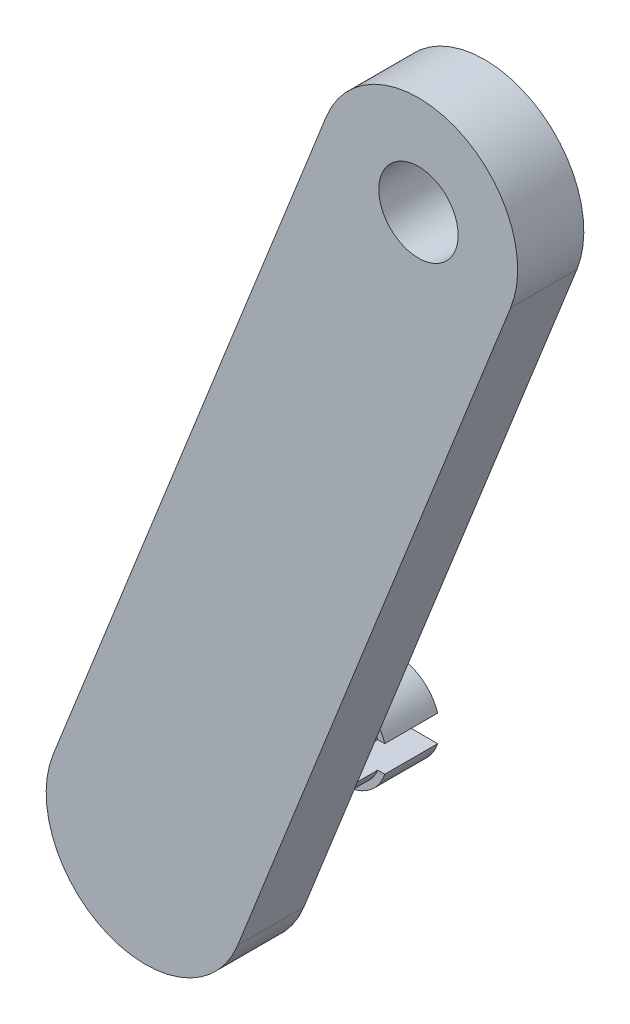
from build123d import *

# Parameters (mm, degrees)
BOSS_EXTRU_1_DEPTH      = 5
ESQUISSE2_R             = 2.75
BOSS_EXTRU_2_DEPTH      = 15
ESQUISSE4_R             = 3.25
BOSS_EXTRU_3_DEPTH      = 4
ESQUISSE5_W             = 10
ESQUISSE5_H             = 2
ENL_V_MAT_EXTRU_2_DEPTH = 14
ESQUISSE6_R             = 3
ENL_V_MAT_EXTRU_3_DEPTH = 14


with BuildPart() as part:
    # Esquisse1 → Boss.-Extru.1 (new body)
    with BuildSketch(Plane.XY):
        with BuildLine():
            Line((-57.027974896, -6.764211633), (-77.667421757, -58.821999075))
            ThreePointArc((-77.667421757, -58.821999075), (-87.403658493, -63.029812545), (-91.611471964, -53.293575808))
            Line((-91.611471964, -53.293575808), (-70.972025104, -1.235788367))
            ThreePointArc((-70.972025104, -1.235788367), (-61.235788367, 2.972025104), (-57.027974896, -6.764211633))
        make_face()
    extrude(amount=BOSS_EXTRU_1_DEPTH)

    # Esquisse2 → Boss.-Extru.2 (add)
    with BuildSketch(Plane.XY.offset(5)):
        with Locations((-84.63944686, -56.057787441)):
            Circle(ESQUISSE2_R)
    extrude(amount=-BOSS_EXTRU_2_DEPTH)

    # Esquisse4 → Boss.-Extru.3 (add)
    with BuildSketch(Plane(origin=(0, 0, -10), x_dir=(-1, 0, 0), z_dir=(0, 0, -1))):
        with Locations((84.63944686, -56.057787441)):
            Circle(ESQUISSE4_R)
    extrude(amount=BOSS_EXTRU_3_DEPTH)

    # Esquisse5 → Enl_v. mat.-Extru.2 (cut)
    with BuildSketch(Plane(origin=(0, 0, -14), x_dir=(-1, 0, 0), z_dir=(0, 0, -1))):
        with Locations((84.63944686, -56.057787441)):
            Rectangle(ESQUISSE5_W, ESQUISSE5_H)
    extrude(amount=-ENL_V_MAT_EXTRU_2_DEPTH, mode=Mode.SUBTRACT)

    # Esquisse6 → Enl_v. mat.-Extru.3 (cut)
    with BuildSketch(Plane.XY.offset(5)):
        with Locations((-64, -4)):
            Circle(ESQUISSE6_R)
    extrude(amount=-ENL_V_MAT_EXTRU_3_DEPTH, mode=Mode.SUBTRACT)


solid = part.part
